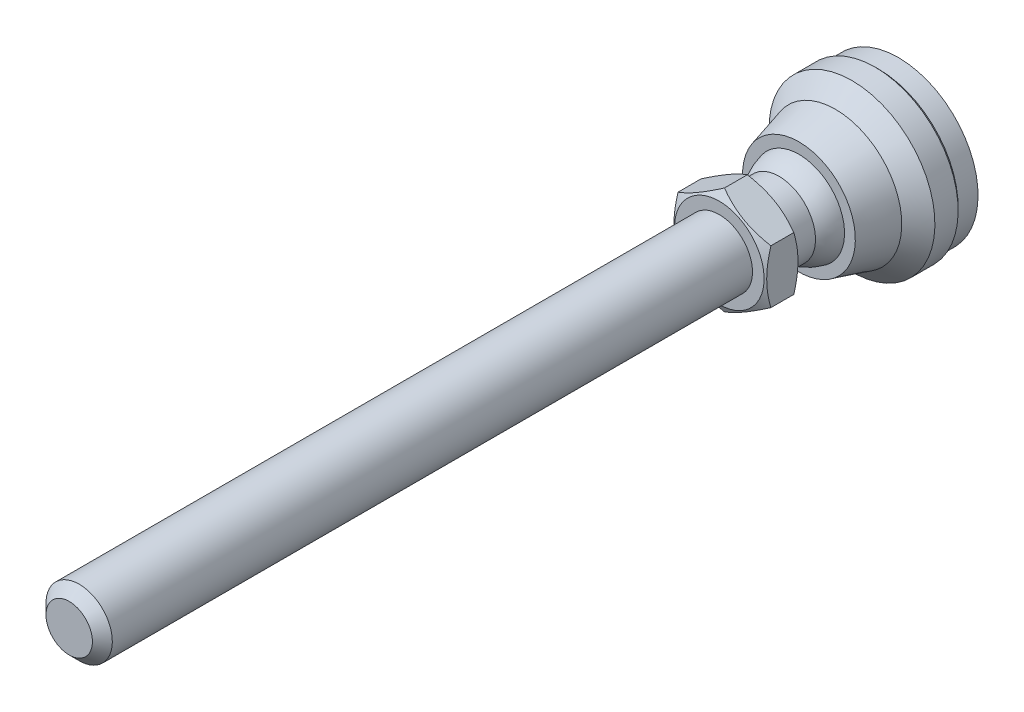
ISO-10303-21;
HEADER;
FILE_DESCRIPTION(('STEP AP214'),'2;1');
FILE_NAME('part.step','',(''),(''),'','','');
FILE_SCHEMA(('AUTOMOTIVE_DESIGN { 1 0 10303 214 1 1 1 1 }'));
ENDSEC;
DATA;
#1=APPLICATION_CONTEXT('core data for automotive mechanical design processes');
#2=APPLICATION_PROTOCOL_DEFINITION('international standard','automotive_design',2000,#1);
#3=PRODUCT_CONTEXT('',#1,'mechanical');
#4=PRODUCT('Part','Part','',(#3));
#5=PRODUCT_RELATED_PRODUCT_CATEGORY('part','',(#4));
#6=PRODUCT_DEFINITION_FORMATION('','',#4);
#7=PRODUCT_DEFINITION_CONTEXT('part definition',#1,'design');
#8=PRODUCT_DEFINITION('design','',#6,#7);
#9=PRODUCT_DEFINITION_SHAPE('','',#8);
#10=(LENGTH_UNIT() NAMED_UNIT(*) SI_UNIT(.MILLI.,.METRE.));
#11=(NAMED_UNIT(*) PLANE_ANGLE_UNIT() SI_UNIT($,.RADIAN.));
#12=(NAMED_UNIT(*) SI_UNIT($,.STERADIAN.) SOLID_ANGLE_UNIT());
#13=UNCERTAINTY_MEASURE_WITH_UNIT(LENGTH_MEASURE(1.E-05),#10,'distance_accuracy_value','');
#14=(GEOMETRIC_REPRESENTATION_CONTEXT(3) GLOBAL_UNCERTAINTY_ASSIGNED_CONTEXT((#13)) GLOBAL_UNIT_ASSIGNED_CONTEXT((#10,
#11,#12)) REPRESENTATION_CONTEXT('',''));
#15=CARTESIAN_POINT('',(0.,0.,0.));
#16=DIRECTION('',(0.,0.,1.));
#17=DIRECTION('',(1.,0.,0.));
#18=AXIS2_PLACEMENT_3D('',#15,#16,#17);
#19=CARTESIAN_POINT('',(-5.49999999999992,0.,22.));
#20=DIRECTION('',(0.,0.,1.));
#21=DIRECTION('',(0.,-1.,0.));
#22=AXIS2_PLACEMENT_3D('',#19,#20,#21);
#23=PLANE('',#22);
#24=CARTESIAN_POINT('',(0.,0.,22.));
#25=DIRECTION('',(0.,0.,1.));
#26=DIRECTION('',(0.,-1.,0.));
#27=AXIS2_PLACEMENT_3D('',#24,#25,#26);
#28=CIRCLE('',#27,6.75);
#29=CARTESIAN_POINT('',(0.,-6.75,22.));
#30=VERTEX_POINT('',#29);
#31=EDGE_CURVE('E440',#30,#30,#28,.T.);
#32=ORIENTED_EDGE('',*,*,#31,.F.);
#33=EDGE_LOOP('',(#32));
#34=FACE_BOUND('',#33,.T.);
#35=CARTESIAN_POINT('',(0.,0.,22.));
#36=DIRECTION('',(0.,0.,-1.));
#37=DIRECTION('',(0.,1.,0.));
#38=AXIS2_PLACEMENT_3D('',#35,#36,#37);
#39=CIRCLE('',#38,5.49999999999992);
#40=CARTESIAN_POINT('',(0.,5.49999999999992,22.));
#41=VERTEX_POINT('',#40);
#42=EDGE_CURVE('E120',#41,#41,#39,.T.);
#43=ORIENTED_EDGE('',*,*,#42,.F.);
#44=EDGE_LOOP('',(#43));
#45=FACE_BOUND('',#44,.T.);
#46=ADVANCED_FACE('F14',(#34,#45),#23,.F.);
#47=CARTESIAN_POINT('',(0.,0.,0.));
#48=DIRECTION('',(0.,0.,-1.));
#49=DIRECTION('',(0.,1.,0.));
#50=AXIS2_PLACEMENT_3D('',#47,#48,#49);
#51=CYLINDRICAL_SURFACE('',#50,5.49999999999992);
#52=CARTESIAN_POINT('',(0.,0.,18.));
#53=DIRECTION('',(0.,0.,-1.));
#54=DIRECTION('',(0.,1.,0.));
#55=AXIS2_PLACEMENT_3D('',#52,#53,#54);
#56=CIRCLE('',#55,5.49999999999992);
#57=CARTESIAN_POINT('',(-5.49999999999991,0.,18.));
#58=VERTEX_POINT('',#57);
#59=EDGE_CURVE('E117',#58,#58,#56,.T.);
#60=ORIENTED_EDGE('',*,*,#59,.F.);
#61=EDGE_LOOP('',(#60));
#62=FACE_BOUND('',#61,.T.);
#63=ORIENTED_EDGE('',*,*,#42,.T.);
#64=EDGE_LOOP('',(#63));
#65=FACE_BOUND('',#64,.T.);
#66=ADVANCED_FACE('F144',(#62,#65),#51,.T.);
#67=CARTESIAN_POINT('',(0.,0.,13.6698729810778));
#68=DIRECTION('',(0.,0.,-1.));
#69=DIRECTION('',(-1.,0.,0.));
#70=AXIS2_PLACEMENT_3D('',#67,#68,#69);
#71=SPHERICAL_SURFACE('',#70,7.);
#72=CARTESIAN_POINT('',(0.,0.,15.));
#73=DIRECTION('',(0.,0.,-1.));
#74=DIRECTION('',(0.,1.,0.));
#75=AXIS2_PLACEMENT_3D('',#72,#73,#74);
#76=CIRCLE('',#75,6.87246404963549);
#77=CARTESIAN_POINT('',(-6.87246404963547,0.,15.));
#78=VERTEX_POINT('',#77);
#79=EDGE_CURVE('E114',#78,#78,#76,.T.);
#80=CARTESIAN_POINT('',(-6.87246404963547,0.,15.));
#81=CARTESIAN_POINT('',(-6.8658721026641,0.,15.0340591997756));
#82=CARTESIAN_POINT('',(-6.85902692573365,0.,15.0680693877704));
#83=CARTESIAN_POINT('',(-6.84483171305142,0.,15.1359842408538));
#84=CARTESIAN_POINT('',(-6.83748167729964,0.,15.1698889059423));
#85=CARTESIAN_POINT('',(-6.82227834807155,0.,15.2375852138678));
#86=CARTESIAN_POINT('',(-6.81442505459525,0.,15.2713768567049));
#87=CARTESIAN_POINT('',(-6.79821695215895,0.,15.3388396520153));
#88=CARTESIAN_POINT('',(-6.78986214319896,0.,15.3725108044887));
#89=CARTESIAN_POINT('',(-6.7726528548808,0.,15.4397251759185));
#90=CARTESIAN_POINT('',(-6.76379837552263,0.,15.473268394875));
#91=CARTESIAN_POINT('',(-6.74559170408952,0.,15.5402194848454));
#92=CARTESIAN_POINT('',(-6.73623951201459,0.,15.5736273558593));
#93=CARTESIAN_POINT('',(-6.71703948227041,0.,15.6403003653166));
#94=CARTESIAN_POINT('',(-6.70719164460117,0.,15.67356550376));
#95=CARTESIAN_POINT('',(-6.68700250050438,0.,15.7399456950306));
#96=CARTESIAN_POINT('',(-6.67666119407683,0.,15.7730607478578));
#97=CARTESIAN_POINT('',(-6.65548739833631,0.,15.8391334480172));
#98=CARTESIAN_POINT('',(-6.64465490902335,0.,15.8720910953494));
#99=CARTESIAN_POINT('',(-6.6225011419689,0.,15.9378416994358));
#100=CARTESIAN_POINT('',(-6.61117986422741,0.,15.9706346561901));
#101=CARTESIAN_POINT('',(-6.5880510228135,0.,16.0360486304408));
#102=CARTESIAN_POINT('',(-6.57624345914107,0.,16.0686696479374));
#103=CARTESIAN_POINT('',(-6.55214465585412,0.,16.1337325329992));
#104=CARTESIAN_POINT('',(-6.5398534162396,0.,16.1661744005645));
#105=CARTESIAN_POINT('',(-6.51478997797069,0.,16.2308718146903));
#106=CARTESIAN_POINT('',(-6.5020177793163,0.,16.2631273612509));
#107=CARTESIAN_POINT('',(-6.47599524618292,0.,16.3274450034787));
#108=CARTESIAN_POINT('',(-6.46274491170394,0.,16.3595070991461));
#109=CARTESIAN_POINT('',(-6.4357690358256,0.,16.4234307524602));
#110=CARTESIAN_POINT('',(-6.42204349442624,0.,16.455292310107));
#111=CARTESIAN_POINT('',(-6.39412023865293,0.,16.5188078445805));
#112=CARTESIAN_POINT('',(-6.37992252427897,0.,16.5504618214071));
#113=CARTESIAN_POINT('',(-6.35105806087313,0.,16.6135551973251));
#114=CARTESIAN_POINT('',(-6.33639131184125,0.,16.6449945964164));
#115=CARTESIAN_POINT('',(-6.30659202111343,0.,16.7076518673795));
#116=CARTESIAN_POINT('',(-6.29145947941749,0.,16.7388697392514));
#117=CARTESIAN_POINT('',(-6.26073194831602,0.,16.8010770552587));
#118=CARTESIAN_POINT('',(-6.24513695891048,0.,16.8320664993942));
#119=CARTESIAN_POINT('',(-6.21348797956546,0.,16.8938101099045));
#120=CARTESIAN_POINT('',(-6.19743398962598,0.,16.9245642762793));
#121=CARTESIAN_POINT('',(-6.16487055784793,0.,16.9858305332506));
#122=CARTESIAN_POINT('',(-6.14836111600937,0.,17.016342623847));
#123=CARTESIAN_POINT('',(-6.11489042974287,0.,17.0771179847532));
#124=CARTESIAN_POINT('',(-6.09792918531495,0.,17.107381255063));
#125=CARTESIAN_POINT('',(-6.06355864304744,0.,17.1676522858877));
#126=CARTESIAN_POINT('',(-6.04614934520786,0.,17.1976600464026));
#127=CARTESIAN_POINT('',(-6.01088654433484,0.,17.2574134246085));
#128=CARTESIAN_POINT('',(-5.99303304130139,0.,17.2871590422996));
#129=CARTESIAN_POINT('',(-5.9568857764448,0.,17.3463815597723));
#130=CARTESIAN_POINT('',(-5.93859201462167,0.,17.3758584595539));
#131=CARTESIAN_POINT('',(-5.90156827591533,0.,17.4345370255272));
#132=CARTESIAN_POINT('',(-5.88283829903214,0.,17.4637386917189));
#133=CARTESIAN_POINT('',(-5.84494627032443,0.,17.5218603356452));
#134=CARTESIAN_POINT('',(-5.82578421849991,0.,17.5507803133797));
#135=CARTESIAN_POINT('',(-5.78703227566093,0.,17.6083321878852));
#136=CARTESIAN_POINT('',(-5.76744238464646,0.,17.6369640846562));
#137=CARTESIAN_POINT('',(-5.72783909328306,0.,17.6939334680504));
#138=CARTESIAN_POINT('',(-5.70782569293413,0.,17.7222709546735));
#139=CARTESIAN_POINT('',(-5.66737980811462,0.,17.778645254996));
#140=CARTESIAN_POINT('',(-5.64694732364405,0.,17.8066820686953));
#141=CARTESIAN_POINT('',(-5.60566778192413,0.,17.862448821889));
#142=CARTESIAN_POINT('',(-5.58482072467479,0.,17.8901787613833));
#143=CARTESIAN_POINT('',(-5.54271666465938,0.,17.9453256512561));
#144=CARTESIAN_POINT('',(-5.52145966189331,0.,17.9727426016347));
#145=CARTESIAN_POINT('',(-5.49999999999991,0.,18.));
#146=B_SPLINE_CURVE_WITH_KNOTS('',3,(#80,#81,#82,#83,#84,#85,#86,#87,#88,#89,#90,#91,#92,#93,
#94,#95,#96,#97,#98,#99,#100,#101,#102,#103,#104,#105,#106,#107,#108,#109,#110,#111,#112,#113,
#114,#115,#116,#117,#118,#119,#120,#121,#122,#123,#124,#125,#126,#127,#128,#129,#130,#131,#132,
#133,#134,#135,#136,#137,#138,#139,#140,#141,#142,#143,#144,#145),.UNSPECIFIED.,.F.,.F.,(4,2,2,
2,2,2,2,2,2,2,2,2,2,2,2,2,2,2,2,2,2,2,2,2,2,2,2,2,2,2,2,2,4),(0.,0.104072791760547,
0.20814558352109,0.312218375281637,0.416291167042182,0.520363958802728,0.624436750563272,
0.728509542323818,0.832582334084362,0.936655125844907,1.04072791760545,1.144800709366,
1.24887350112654,1.35294629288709,1.45701908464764,1.56109187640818,1.66516466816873,
1.76923745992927,1.87331025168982,1.97738304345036,2.0814558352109,2.18552862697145,
2.289601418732,2.39367421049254,2.49774700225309,2.60181979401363,2.70589258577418,
2.80996537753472,2.91403816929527,3.01811096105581,3.12218375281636,3.2262565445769,
3.33032933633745),.UNSPECIFIED.);
#147=EDGE_CURVE('BSEAM151',#78,#58,#146,.T.);
#148=ORIENTED_EDGE('',*,*,#79,.F.);
#149=ORIENTED_EDGE('',*,*,#59,.T.);
#150=ORIENTED_EDGE('',*,*,#147,.T.);
#151=ORIENTED_EDGE('',*,*,#147,.F.);
#152=EDGE_LOOP('',(#148,#150,#149,#151));
#153=FACE_BOUND('',#152,.T.);
#154=ADVANCED_FACE('F151',(#153),#71,.T.);
#155=CARTESIAN_POINT('',(-8.5,0.,15.));
#156=DIRECTION('',(0.,0.,-1.));
#157=DIRECTION('',(0.,1.,0.));
#158=AXIS2_PLACEMENT_3D('',#155,#156,#157);
#159=PLANE('',#158);
#160=CARTESIAN_POINT('',(0.,0.,15.));
#161=DIRECTION('',(0.,0.,-1.));
#162=DIRECTION('',(0.,1.,0.));
#163=AXIS2_PLACEMENT_3D('',#160,#161,#162);
#164=CIRCLE('',#163,8.5);
#165=CARTESIAN_POINT('',(0.,8.5,15.));
#166=VERTEX_POINT('',#165);
#167=EDGE_CURVE('E111',#166,#166,#164,.T.);
#168=ORIENTED_EDGE('',*,*,#167,.F.);
#169=EDGE_LOOP('',(#168));
#170=FACE_BOUND('',#169,.T.);
#171=ORIENTED_EDGE('',*,*,#79,.T.);
#172=EDGE_LOOP('',(#171));
#173=FACE_BOUND('',#172,.T.);
#174=ADVANCED_FACE('F303',(#170,#173),#159,.F.);
#175=CARTESIAN_POINT('',(0.,0.,15.));
#176=DIRECTION('',(0.,0.,-1.));
#177=DIRECTION('',(0.,1.,0.));
#178=AXIS2_PLACEMENT_3D('',#175,#176,#177);
#179=CONICAL_SURFACE('',#178,8.5,0.266252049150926);
#180=CARTESIAN_POINT('',(0.,0.,9.5));
#181=DIRECTION('',(0.,0.,-1.));
#182=DIRECTION('',(0.,1.,0.));
#183=AXIS2_PLACEMENT_3D('',#180,#181,#182);
#184=CIRCLE('',#183,10.);
#185=CARTESIAN_POINT('',(0.,10.,9.5));
#186=VERTEX_POINT('',#185);
#187=EDGE_CURVE('E108',#186,#186,#184,.T.);
#188=ORIENTED_EDGE('',*,*,#187,.F.);
#189=EDGE_LOOP('',(#188));
#190=FACE_BOUND('',#189,.T.);
#191=ORIENTED_EDGE('',*,*,#167,.T.);
#192=EDGE_LOOP('',(#191));
#193=FACE_BOUND('',#192,.T.);
#194=ADVANCED_FACE('F293',(#190,#193),#179,.T.);
#195=CARTESIAN_POINT('',(0.,0.,9.5));
#196=DIRECTION('',(0.,0.,-1.));
#197=DIRECTION('',(0.,1.,0.));
#198=AXIS2_PLACEMENT_3D('',#195,#196,#197);
#199=CONICAL_SURFACE('',#198,10.,0.785398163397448);
#200=CARTESIAN_POINT('',(0.,0.,7.));
#201=DIRECTION('',(0.,0.,-1.));
#202=DIRECTION('',(0.,1.,0.));
#203=AXIS2_PLACEMENT_3D('',#200,#201,#202);
#204=CIRCLE('',#203,12.5);
#205=CARTESIAN_POINT('',(0.,12.5,7.));
#206=VERTEX_POINT('',#205);
#207=EDGE_CURVE('E105',#206,#206,#204,.T.);
#208=ORIENTED_EDGE('',*,*,#207,.F.);
#209=EDGE_LOOP('',(#208));
#210=FACE_BOUND('',#209,.T.);
#211=ORIENTED_EDGE('',*,*,#187,.T.);
#212=EDGE_LOOP('',(#211));
#213=FACE_BOUND('',#212,.T.);
#214=ADVANCED_FACE('F283',(#210,#213),#199,.T.);
#215=CARTESIAN_POINT('',(0.,0.,0.));
#216=DIRECTION('',(0.,0.,-1.));
#217=DIRECTION('',(0.,1.,0.));
#218=AXIS2_PLACEMENT_3D('',#215,#216,#217);
#219=CYLINDRICAL_SURFACE('',#218,12.5);
#220=CARTESIAN_POINT('',(0.,0.,3.5));
#221=DIRECTION('',(0.,0.,-1.));
#222=DIRECTION('',(0.,1.,0.));
#223=AXIS2_PLACEMENT_3D('',#220,#221,#222);
#224=CIRCLE('',#223,12.5);
#225=CARTESIAN_POINT('',(0.,12.5,3.5));
#226=VERTEX_POINT('',#225);
#227=EDGE_CURVE('E102',#226,#226,#224,.T.);
#228=ORIENTED_EDGE('',*,*,#227,.F.);
#229=EDGE_LOOP('',(#228));
#230=FACE_BOUND('',#229,.T.);
#231=ORIENTED_EDGE('',*,*,#207,.T.);
#232=EDGE_LOOP('',(#231));
#233=FACE_BOUND('',#232,.T.);
#234=ADVANCED_FACE('F273',(#230,#233),#219,.T.);
#235=CARTESIAN_POINT('',(0.,0.,3.5));
#236=DIRECTION('',(0.,0.,1.));
#237=DIRECTION('',(0.,-1.,0.));
#238=AXIS2_PLACEMENT_3D('',#235,#236,#237);
#239=CONICAL_SURFACE('',#238,12.5,0.785398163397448);
#240=CARTESIAN_POINT('',(0.,0.,3.));
#241=DIRECTION('',(0.,0.,-1.));
#242=DIRECTION('',(0.,1.,0.));
#243=AXIS2_PLACEMENT_3D('',#240,#241,#242);
#244=CIRCLE('',#243,12.);
#245=CARTESIAN_POINT('',(0.,12.,3.));
#246=VERTEX_POINT('',#245);
#247=EDGE_CURVE('E99',#246,#246,#244,.T.);
#248=ORIENTED_EDGE('',*,*,#247,.F.);
#249=EDGE_LOOP('',(#248));
#250=FACE_BOUND('',#249,.T.);
#251=ORIENTED_EDGE('',*,*,#227,.T.);
#252=EDGE_LOOP('',(#251));
#253=FACE_BOUND('',#252,.T.);
#254=ADVANCED_FACE('F263',(#250,#253),#239,.T.);
#255=CARTESIAN_POINT('',(0.,0.,0.));
#256=DIRECTION('',(0.,0.,-1.));
#257=DIRECTION('',(0.,1.,0.));
#258=AXIS2_PLACEMENT_3D('',#255,#256,#257);
#259=CYLINDRICAL_SURFACE('',#258,12.);
#260=CARTESIAN_POINT('',(0.,0.,0.));
#261=DIRECTION('',(0.,0.,-1.));
#262=DIRECTION('',(0.,1.,0.));
#263=AXIS2_PLACEMENT_3D('',#260,#261,#262);
#264=CIRCLE('',#263,12.);
#265=CARTESIAN_POINT('',(0.,12.,0.));
#266=VERTEX_POINT('',#265);
#267=EDGE_CURVE('E96',#266,#266,#264,.T.);
#268=ORIENTED_EDGE('',*,*,#267,.F.);
#269=EDGE_LOOP('',(#268));
#270=FACE_BOUND('',#269,.T.);
#271=ORIENTED_EDGE('',*,*,#247,.T.);
#272=EDGE_LOOP('',(#271));
#273=FACE_BOUND('',#272,.T.);
#274=ADVANCED_FACE('F252',(#270,#273),#259,.T.);
#275=CARTESIAN_POINT('',(-12.,0.,0.));
#276=DIRECTION('',(0.,0.,1.));
#277=DIRECTION('',(0.,-1.,0.));
#278=AXIS2_PLACEMENT_3D('',#275,#276,#277);
#279=PLANE('',#278);
#280=ORIENTED_EDGE('',*,*,#267,.T.);
#281=EDGE_LOOP('',(#280));
#282=FACE_BOUND('',#281,.T.);
#283=ADVANCED_FACE('F142',(#282),#279,.F.);
#284=CARTESIAN_POINT('',(0.,0.,22.));
#285=DIRECTION('',(0.,0.,1.));
#286=DIRECTION('',(0.,-1.,0.));
#287=AXIS2_PLACEMENT_3D('',#284,#285,#286);
#288=CONICAL_SURFACE('',#287,6.75,1.0471975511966);
#289=CARTESIAN_POINT('',(0.000200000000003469,-8.0830192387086,22.7696190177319));
#290=CARTESIAN_POINT('',(-0.15366790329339,-7.99418356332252,22.7183374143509));
#291=CARTESIAN_POINT('',(-0.308109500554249,-7.90501666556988,22.669383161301));
#292=CARTESIAN_POINT('',(-0.618246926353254,-7.72595873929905,22.5767703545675));
#293=CARTESIAN_POINT('',(-0.773943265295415,-7.63606741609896,22.5331140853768));
#294=CARTESIAN_POINT('',(-1.24352516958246,-7.36495417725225,22.4109491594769));
#295=CARTESIAN_POINT('',(-1.5592643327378,-7.18266208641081,22.3414631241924));
#296=CARTESIAN_POINT('',(-2.03176224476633,-6.90986528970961,22.2599825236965));
#297=CARTESIAN_POINT('',(-2.18710922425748,-6.82017566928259,22.2367710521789));
#298=CARTESIAN_POINT('',(-2.49850511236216,-6.64039116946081,22.1978487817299));
#299=CARTESIAN_POINT('',(-2.65455395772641,-6.55029632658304,22.1821373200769));
#300=CARTESIAN_POINT('',(-2.96692267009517,-6.36995016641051,22.1586154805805));
#301=CARTESIAN_POINT('',(-3.12324202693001,-6.27969914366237,22.1507961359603));
#302=CARTESIAN_POINT('',(-3.43601650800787,-6.09911871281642,22.1432178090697));
#303=CARTESIAN_POINT('',(-3.59247162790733,-6.00878930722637,22.1434585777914));
#304=CARTESIAN_POINT('',(-4.02110687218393,-5.76131663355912,22.155197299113));
#305=CARTESIAN_POINT('',(-4.2931466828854,-5.60425437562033,22.1749033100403));
#306=CARTESIAN_POINT('',(-4.83541944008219,-5.29117305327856,22.2373910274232));
#307=CARTESIAN_POINT('',(-5.10565047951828,-5.13515508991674,22.2801940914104));
#308=CARTESIAN_POINT('',(-5.64901454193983,-4.82144370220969,22.3871892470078));
#309=CARTESIAN_POINT('',(-5.92207900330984,-4.6637898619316,22.4518346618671));
#310=CARTESIAN_POINT('',(-6.46413578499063,-4.35083323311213,22.5985536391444));
#311=CARTESIAN_POINT('',(-6.73313504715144,-4.19552643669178,22.680592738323));
#312=CARTESIAN_POINT('',(-7.0002,-4.04133641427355,22.7696190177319));
#313=B_SPLINE_CURVE_WITH_KNOTS('',3,(#289,#290,#291,#292,#293,#294,#295,#296,#297,#298,#299,
#300,#301,#302,#303,#304,#305,#306,#307,#308,#309,#310,#311,#312),.UNSPECIFIED.,.F.,.F.,(4,2,2,
2,2,2,2,2,2,2,2,4),(0.,0.554727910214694,1.10969417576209,2.2219327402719,2.76443041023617,
3.30688013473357,3.8487128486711,4.39052882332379,5.33376515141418,6.27787517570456,
7.24292418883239,8.20607866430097),.UNSPECIFIED.);
#314=CARTESIAN_POINT('',(0.,-8.08290376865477,22.7695523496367));
#315=VERTEX_POINT('',#314);
#316=CARTESIAN_POINT('',(-7.,-4.04145188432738,22.7695523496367));
#317=VERTEX_POINT('',#316);
#318=EDGE_CURVE('E73',#315,#317,#313,.T.);
#319=ORIENTED_EDGE('',*,*,#318,.T.);
#320=CARTESIAN_POINT('',(-7.,10.812673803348,25.5395945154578));
#321=CARTESIAN_POINT('',(-7.,10.5072958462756,25.3916329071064));
#322=CARTESIAN_POINT('',(-7.,10.2012122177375,25.24510256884));
#323=CARTESIAN_POINT('',(-7.,9.58725816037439,24.9557102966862));
#324=CARTESIAN_POINT('',(-7.,9.27938745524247,24.8128489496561));
#325=CARTESIAN_POINT('',(-7.,8.65987674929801,24.5308725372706));
#326=CARTESIAN_POINT('',(-7.,8.34822532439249,24.3917824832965));
#327=CARTESIAN_POINT('',(-7.,7.7224285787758,24.1193524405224));
#328=CARTESIAN_POINT('',(-7.,7.40828337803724,23.9860121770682));
#329=CARTESIAN_POINT('',(-7.,6.76702963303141,23.7225044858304));
#330=CARTESIAN_POINT('',(-7.,6.43982484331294,23.5925699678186));
#331=CARTESIAN_POINT('',(-7.,5.78157207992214,23.3426397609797));
#332=CARTESIAN_POINT('',(-7.,5.4505236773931,23.2226451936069));
#333=CARTESIAN_POINT('',(-7.,4.78468670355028,22.9957770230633));
#334=CARTESIAN_POINT('',(-7.,4.44990741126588,22.8888764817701));
#335=CARTESIAN_POINT('',(-7.,3.77555914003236,22.6916535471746));
#336=CARTESIAN_POINT('',(-7.,3.43599172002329,22.6013258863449));
#337=CARTESIAN_POINT('',(-7.,2.75369265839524,22.4420957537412));
#338=CARTESIAN_POINT('',(-7.,2.41098847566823,22.3730788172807));
#339=CARTESIAN_POINT('',(-7.,1.89384626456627,22.2885462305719));
#340=CARTESIAN_POINT('',(-7.,1.72093817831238,22.2635330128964));
#341=CARTESIAN_POINT('',(-7.,1.37427732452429,22.2203290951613));
#342=CARTESIAN_POINT('',(-7.,1.20052464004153,22.2021377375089));
#343=CARTESIAN_POINT('',(-7.,0.854658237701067,22.1731658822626));
#344=CARTESIAN_POINT('',(-7.,0.682552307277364,22.1622927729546));
#345=CARTESIAN_POINT('',(-7.,0.338035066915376,22.1478313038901));
#346=CARTESIAN_POINT('',(-7.,0.165623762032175,22.1442428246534));
#347=CARTESIAN_POINT('',(-7.,-0.179196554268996,22.1444361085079));
#348=CARTESIAN_POINT('',(-7.,-0.351605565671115,22.1482179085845));
#349=CARTESIAN_POINT('',(-7.,-0.696112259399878,22.1630600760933));
#350=CARTESIAN_POINT('',(-7.,-0.868209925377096,22.1741208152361));
#351=CARTESIAN_POINT('',(-7.,-1.2831299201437,22.2093299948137));
#352=CARTESIAN_POINT('',(-7.,-1.5256591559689,22.2370051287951));
#353=CARTESIAN_POINT('',(-7.,-2.00887768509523,22.3052913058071));
#354=CARTESIAN_POINT('',(-7.,-2.24956671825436,22.3459041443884));
#355=CARTESIAN_POINT('',(-7.,-2.96862070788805,22.4849922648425));
#356=CARTESIAN_POINT('',(-7.,-3.44369601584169,22.6006906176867));
#357=CARTESIAN_POINT('',(-7.,-4.15400509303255,22.8008201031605));
#358=CARTESIAN_POINT('',(-7.,-4.39293574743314,22.8728804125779));
#359=CARTESIAN_POINT('',(-7.,-4.86847553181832,23.0243603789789));
#360=CARTESIAN_POINT('',(-7.,-5.10508464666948,23.1037800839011));
#361=CARTESIAN_POINT('',(-7.,-5.57605822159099,23.2687149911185));
#362=CARTESIAN_POINT('',(-7.,-5.81042342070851,23.3542281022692));
#363=CARTESIAN_POINT('',(-7.,-6.27722046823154,23.5303561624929));
#364=CARTESIAN_POINT('',(-7.,-6.50965233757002,23.620971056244));
#365=CARTESIAN_POINT('',(-7.,-7.05113691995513,23.8378263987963));
#366=CARTESIAN_POINT('',(-7.,-7.35951426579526,23.9657499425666));
#367=CARTESIAN_POINT('',(-7.,-7.97370763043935,24.2276218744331));
#368=CARTESIAN_POINT('',(-7.,-8.27952350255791,24.3615706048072));
#369=CARTESIAN_POINT('',(-7.,-8.88905585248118,24.6343026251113));
#370=CARTESIAN_POINT('',(-7.,-9.19277192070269,24.7730868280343));
#371=CARTESIAN_POINT('',(-7.,-9.79840263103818,25.0545384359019));
#372=CARTESIAN_POINT('',(-7.,-10.1003172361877,25.1972059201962));
#373=CARTESIAN_POINT('',(-7.,-10.7029368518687,25.4858508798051));
#374=CARTESIAN_POINT('',(-7.,-11.0036403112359,25.6318315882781));
#375=CARTESIAN_POINT('',(-7.,-11.6037651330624,25.9264073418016));
#376=CARTESIAN_POINT('',(-7.,-11.9031864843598,26.0750024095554));
#377=CARTESIAN_POINT('',(-7.,-12.7997540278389,26.5239864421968));
#378=CARTESIAN_POINT('',(-7.,-13.3952797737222,26.8276109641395));
#379=CARTESIAN_POINT('',(-7.,-14.5345308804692,27.4158411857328));
#380=CARTESIAN_POINT('',(-7.,-15.0785045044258,27.6999681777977));
#381=CARTESIAN_POINT('',(-7.,-16.1644249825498,28.2721098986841));
#382=CARTESIAN_POINT('',(-7.,-16.7063717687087,28.5601247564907));
#383=CARTESIAN_POINT('',(-7.,-17.7873838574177,29.138429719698));
#384=CARTESIAN_POINT('',(-7.,-18.3264529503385,29.4287127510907));
#385=CARTESIAN_POINT('',(-7.,-19.4032911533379,30.011613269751));
#386=CARTESIAN_POINT('',(-7.,-19.9410603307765,30.3042306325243));
#387=CARTESIAN_POINT('',(-7.,-20.4783490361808,30.5977216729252));
#388=B_SPLINE_CURVE_WITH_KNOTS('',3,(#320,#321,#322,#323,#324,#325,#326,#327,#328,#329,#330,
#331,#332,#333,#334,#335,#336,#337,#338,#339,#340,#341,#342,#343,#344,#345,#346,#347,#348,#349,
#350,#351,#352,#353,#354,#355,#356,#357,#358,#359,#360,#361,#362,#363,#364,#365,#366,#367,#368,
#369,#370,#371,#372,#373,#374,#375,#376,#377,#378,#379,#380,#381,#382,#383,#384,#385,#386,#387),
.UNSPECIFIED.,.F.,.F.,(4,2,2,2,2,2,2,2,2,2,2,2,2,2,2,2,2,2,2,2,2,2,2,2,2,2,2,2,2,2,2,2,2,4),(0.,
1.01801804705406,2.03619792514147,3.05999411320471,4.08374134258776,5.139794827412,
6.19596729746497,7.24992906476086,8.30355525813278,9.35141958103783,9.87543000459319,
10.3993899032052,10.9165877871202,11.4337771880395,11.9509691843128,12.4681875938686,
13.2000825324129,13.9320790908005,15.3969019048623,16.1455231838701,16.8941493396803,
17.6425198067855,18.3908821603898,19.3923699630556,20.3939147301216,21.3956496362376,
22.3974050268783,23.4001839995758,24.4029716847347,26.4082936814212,28.2493958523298,
30.0905592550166,31.9273268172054,33.7639970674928),.UNSPECIFIED.);
#389=CARTESIAN_POINT('',(-7.,4.04145188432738,22.7695523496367));
#390=VERTEX_POINT('',#389);
#391=EDGE_CURVE('E81',#317,#390,#388,.F.);
#392=ORIENTED_EDGE('',*,*,#391,.T.);
#393=CARTESIAN_POINT('',(-7.0002,4.04133641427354,22.7696190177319));
#394=CARTESIAN_POINT('',(-6.84633209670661,4.13017208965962,22.7183374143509));
#395=CARTESIAN_POINT('',(-6.69189049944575,4.21933898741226,22.669383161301));
#396=CARTESIAN_POINT('',(-6.38175307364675,4.39839691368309,22.5767703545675));
#397=CARTESIAN_POINT('',(-6.22605673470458,4.48828823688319,22.5331140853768));
#398=CARTESIAN_POINT('',(-5.75647483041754,4.75940147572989,22.4109491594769));
#399=CARTESIAN_POINT('',(-5.4407356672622,4.94169356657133,22.3414631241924));
#400=CARTESIAN_POINT('',(-4.96823775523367,5.21449036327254,22.2599825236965));
#401=CARTESIAN_POINT('',(-4.81289077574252,5.30417998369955,22.2367710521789));
#402=CARTESIAN_POINT('',(-4.50149488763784,5.48396448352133,22.1978487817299));
#403=CARTESIAN_POINT('',(-4.34544604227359,5.57405932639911,22.1821373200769));
#404=CARTESIAN_POINT('',(-4.03307732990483,5.75440548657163,22.1586154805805));
#405=CARTESIAN_POINT('',(-3.87675797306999,5.84465650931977,22.1507961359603));
#406=CARTESIAN_POINT('',(-3.56398349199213,6.02523694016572,22.1432178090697));
#407=CARTESIAN_POINT('',(-3.40752837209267,6.11556634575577,22.1434585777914));
#408=CARTESIAN_POINT('',(-2.97889312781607,6.36303901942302,22.155197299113));
#409=CARTESIAN_POINT('',(-2.7068533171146,6.52010127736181,22.1749033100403));
#410=CARTESIAN_POINT('',(-2.16458055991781,6.83318259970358,22.2373910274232));
#411=CARTESIAN_POINT('',(-1.89434952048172,6.9892005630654,22.2801940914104));
#412=CARTESIAN_POINT('',(-1.35098545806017,7.30291195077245,22.3871892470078));
#413=CARTESIAN_POINT('',(-1.07792099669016,7.46056579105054,22.4518346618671));
#414=CARTESIAN_POINT('',(-0.535864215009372,7.77352241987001,22.5985536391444));
#415=CARTESIAN_POINT('',(-0.266864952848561,7.92882921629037,22.680592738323));
#416=CARTESIAN_POINT('',(0.00019999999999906,8.0830192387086,22.7696190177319));
#417=B_SPLINE_CURVE_WITH_KNOTS('',3,(#393,#394,#395,#396,#397,#398,#399,#400,#401,#402,#403,
#404,#405,#406,#407,#408,#409,#410,#411,#412,#413,#414,#415,#416),.UNSPECIFIED.,.F.,.F.,(4,2,2,
2,2,2,2,2,2,2,2,4),(0.,0.554727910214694,1.10969417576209,2.2219327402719,2.76443041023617,
3.30688013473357,3.84871284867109,4.39052882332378,5.33376515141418,6.27787517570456,
7.2429241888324,8.20607866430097),.UNSPECIFIED.);
#418=CARTESIAN_POINT('',(0.,8.08290376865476,22.7695523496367));
#419=VERTEX_POINT('',#418);
#420=EDGE_CURVE('E395',#390,#419,#417,.T.);
#421=ORIENTED_EDGE('',*,*,#420,.T.);
#422=CARTESIAN_POINT('',(-0.000200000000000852,8.0830192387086,22.7696190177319));
#423=CARTESIAN_POINT('',(0.153667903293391,7.99418356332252,22.7183374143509));
#424=CARTESIAN_POINT('',(0.308109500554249,7.90501666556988,22.669383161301));
#425=CARTESIAN_POINT('',(0.618246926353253,7.72595873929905,22.5767703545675));
#426=CARTESIAN_POINT('',(0.773943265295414,7.63606741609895,22.5331140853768));
#427=CARTESIAN_POINT('',(1.24352516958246,7.36495417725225,22.4109491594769));
#428=CARTESIAN_POINT('',(1.5592643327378,7.18266208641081,22.3414631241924));
#429=CARTESIAN_POINT('',(2.03176224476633,6.9098652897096,22.2599825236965));
#430=CARTESIAN_POINT('',(2.18710922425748,6.82017566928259,22.2367710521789));
#431=CARTESIAN_POINT('',(2.49850511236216,6.64039116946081,22.1978487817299));
#432=CARTESIAN_POINT('',(2.65455395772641,6.55029632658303,22.1821373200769));
#433=CARTESIAN_POINT('',(2.96692267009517,6.36995016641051,22.1586154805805));
#434=CARTESIAN_POINT('',(3.12324202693,6.27969914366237,22.1507961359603));
#435=CARTESIAN_POINT('',(3.43601650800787,6.09911871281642,22.1432178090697));
#436=CARTESIAN_POINT('',(3.59247162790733,6.00878930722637,22.1434585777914));
#437=CARTESIAN_POINT('',(4.02110687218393,5.76131663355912,22.155197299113));
#438=CARTESIAN_POINT('',(4.2931466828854,5.60425437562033,22.1749033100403));
#439=CARTESIAN_POINT('',(4.83541944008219,5.29117305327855,22.2373910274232));
#440=CARTESIAN_POINT('',(5.10565047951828,5.13515508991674,22.2801940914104));
#441=CARTESIAN_POINT('',(5.64901454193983,4.82144370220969,22.3871892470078));
#442=CARTESIAN_POINT('',(5.92207900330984,4.66378986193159,22.4518346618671));
#443=CARTESIAN_POINT('',(6.46413578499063,4.35083323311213,22.5985536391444));
#444=CARTESIAN_POINT('',(6.73313504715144,4.19552643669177,22.680592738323));
#445=CARTESIAN_POINT('',(7.0002,4.04133641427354,22.7696190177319));
#446=B_SPLINE_CURVE_WITH_KNOTS('',3,(#422,#423,#424,#425,#426,#427,#428,#429,#430,#431,#432,
#433,#434,#435,#436,#437,#438,#439,#440,#441,#442,#443,#444,#445),.UNSPECIFIED.,.F.,.F.,(4,2,2,
2,2,2,2,2,2,2,2,4),(0.,0.554727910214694,1.10969417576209,2.2219327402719,2.76443041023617,
3.30688013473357,3.8487128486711,4.39052882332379,5.33376515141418,6.27787517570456,
7.2429241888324,8.20607866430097),.UNSPECIFIED.);
#447=CARTESIAN_POINT('',(7.,4.04145188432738,22.7695523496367));
#448=VERTEX_POINT('',#447);
#449=EDGE_CURVE('E390',#419,#448,#446,.T.);
#450=ORIENTED_EDGE('',*,*,#449,.T.);
#451=CARTESIAN_POINT('',(7.,10.8126738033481,25.5395945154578));
#452=CARTESIAN_POINT('',(7.,10.5072958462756,25.3916329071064));
#453=CARTESIAN_POINT('',(7.,10.2012122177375,25.24510256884));
#454=CARTESIAN_POINT('',(7.,9.5872581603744,24.9557102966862));
#455=CARTESIAN_POINT('',(7.,9.27938745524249,24.8128489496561));
#456=CARTESIAN_POINT('',(7.,8.65987674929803,24.5308725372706));
#457=CARTESIAN_POINT('',(7.,8.3482253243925,24.3917824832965));
#458=CARTESIAN_POINT('',(7.,7.72242857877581,24.1193524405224));
#459=CARTESIAN_POINT('',(7.,7.40828337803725,23.9860121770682));
#460=CARTESIAN_POINT('',(7.,6.76702963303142,23.7225044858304));
#461=CARTESIAN_POINT('',(7.,6.43982484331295,23.5925699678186));
#462=CARTESIAN_POINT('',(7.,5.78157207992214,23.3426397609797));
#463=CARTESIAN_POINT('',(7.,5.45052367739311,23.2226451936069));
#464=CARTESIAN_POINT('',(7.,4.78468670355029,22.9957770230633));
#465=CARTESIAN_POINT('',(7.,4.44990741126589,22.8888764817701));
#466=CARTESIAN_POINT('',(7.,3.77555914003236,22.6916535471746));
#467=CARTESIAN_POINT('',(7.,3.4359917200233,22.6013258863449));
#468=CARTESIAN_POINT('',(7.,2.75369265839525,22.4420957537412));
#469=CARTESIAN_POINT('',(7.,2.41098847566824,22.3730788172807));
#470=CARTESIAN_POINT('',(7.,1.89384626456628,22.2885462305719));
#471=CARTESIAN_POINT('',(7.,1.72093817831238,22.2635330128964));
#472=CARTESIAN_POINT('',(7.,1.3742773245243,22.2203290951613));
#473=CARTESIAN_POINT('',(7.,1.20052464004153,22.2021377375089));
#474=CARTESIAN_POINT('',(7.,0.854658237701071,22.1731658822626));
#475=CARTESIAN_POINT('',(7.,0.682552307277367,22.1622927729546));
#476=CARTESIAN_POINT('',(7.,0.338035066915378,22.1478313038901));
#477=CARTESIAN_POINT('',(7.,0.165623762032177,22.1442428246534));
#478=CARTESIAN_POINT('',(7.,-0.179196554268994,22.1444361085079));
#479=CARTESIAN_POINT('',(7.,-0.351605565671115,22.1482179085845));
#480=CARTESIAN_POINT('',(7.,-0.696112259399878,22.1630600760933));
#481=CARTESIAN_POINT('',(7.,-0.868209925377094,22.1741208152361));
#482=CARTESIAN_POINT('',(7.,-1.2831299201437,22.2093299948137));
#483=CARTESIAN_POINT('',(7.,-1.5256591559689,22.2370051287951));
#484=CARTESIAN_POINT('',(7.,-2.00887768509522,22.3052913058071));
#485=CARTESIAN_POINT('',(7.,-2.24956671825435,22.3459041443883));
#486=CARTESIAN_POINT('',(7.,-2.96862070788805,22.4849922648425));
#487=CARTESIAN_POINT('',(7.,-3.44369601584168,22.6006906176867));
#488=CARTESIAN_POINT('',(7.,-4.15400509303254,22.8008201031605));
#489=CARTESIAN_POINT('',(7.,-4.39293574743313,22.8728804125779));
#490=CARTESIAN_POINT('',(7.,-4.86847553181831,23.0243603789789));
#491=CARTESIAN_POINT('',(7.,-5.10508464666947,23.1037800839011));
#492=CARTESIAN_POINT('',(7.,-5.57605822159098,23.2687149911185));
#493=CARTESIAN_POINT('',(7.,-5.8104234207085,23.3542281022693));
#494=CARTESIAN_POINT('',(7.,-6.27722046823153,23.5303561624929));
#495=CARTESIAN_POINT('',(7.,-6.50965233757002,23.620971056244));
#496=CARTESIAN_POINT('',(7.,-7.05113691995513,23.8378263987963));
#497=CARTESIAN_POINT('',(7.,-7.35951426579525,23.9657499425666));
#498=CARTESIAN_POINT('',(7.,-7.97370763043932,24.2276218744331));
#499=CARTESIAN_POINT('',(7.,-8.27952350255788,24.3615706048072));
#500=CARTESIAN_POINT('',(7.,-8.88905585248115,24.6343026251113));
#501=CARTESIAN_POINT('',(7.,-9.19277192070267,24.7730868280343));
#502=CARTESIAN_POINT('',(7.,-9.79840263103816,25.0545384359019));
#503=CARTESIAN_POINT('',(7.,-10.1003172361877,25.1972059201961));
#504=CARTESIAN_POINT('',(7.,-10.7029368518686,25.4858508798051));
#505=CARTESIAN_POINT('',(7.,-11.0036403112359,25.6318315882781));
#506=CARTESIAN_POINT('',(7.,-11.6037651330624,25.9264073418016));
#507=CARTESIAN_POINT('',(7.,-11.9031864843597,26.0750024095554));
#508=CARTESIAN_POINT('',(7.,-12.7997540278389,26.5239864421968));
#509=CARTESIAN_POINT('',(7.,-13.3952797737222,26.8276109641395));
#510=CARTESIAN_POINT('',(7.,-14.5345308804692,27.4158411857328));
#511=CARTESIAN_POINT('',(7.,-15.0785045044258,27.6999681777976));
#512=CARTESIAN_POINT('',(7.,-16.1644249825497,28.2721098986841));
#513=CARTESIAN_POINT('',(7.,-16.7063717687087,28.5601247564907));
#514=CARTESIAN_POINT('',(7.,-17.7873838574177,29.138429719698));
#515=CARTESIAN_POINT('',(7.,-18.3264529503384,29.4287127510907));
#516=CARTESIAN_POINT('',(7.,-19.4032911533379,30.011613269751));
#517=CARTESIAN_POINT('',(7.,-19.9410603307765,30.3042306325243));
#518=CARTESIAN_POINT('',(7.,-20.4783490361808,30.5977216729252));
#519=B_SPLINE_CURVE_WITH_KNOTS('',3,(#451,#452,#453,#454,#455,#456,#457,#458,#459,#460,#461,
#462,#463,#464,#465,#466,#467,#468,#469,#470,#471,#472,#473,#474,#475,#476,#477,#478,#479,#480,
#481,#482,#483,#484,#485,#486,#487,#488,#489,#490,#491,#492,#493,#494,#495,#496,#497,#498,#499,
#500,#501,#502,#503,#504,#505,#506,#507,#508,#509,#510,#511,#512,#513,#514,#515,#516,#517,#518),
.UNSPECIFIED.,.F.,.F.,(4,2,2,2,2,2,2,2,2,2,2,2,2,2,2,2,2,2,2,2,2,2,2,2,2,2,2,2,2,2,2,2,2,4),(0.,
1.01801804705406,2.03619792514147,3.05999411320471,4.08374134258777,5.13979482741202,
6.19596729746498,7.24992906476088,8.30355525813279,9.35141958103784,9.8754300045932,
10.3993899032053,10.9165877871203,11.4337771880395,11.9509691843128,12.4681875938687,
13.2000825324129,13.9320790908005,15.3969019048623,16.1455231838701,16.8941493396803,
17.6425198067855,18.3908821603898,19.3923699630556,20.3939147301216,21.3956496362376,
22.3974050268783,23.4001839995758,24.4029716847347,26.4082936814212,28.2493958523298,
30.0905592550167,31.9273268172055,33.7639970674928),.UNSPECIFIED.);
#520=CARTESIAN_POINT('',(7.,-4.04145188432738,22.7695523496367));
#521=VERTEX_POINT('',#520);
#522=EDGE_CURVE('E34',#448,#521,#519,.T.);
#523=ORIENTED_EDGE('',*,*,#522,.T.);
#524=CARTESIAN_POINT('',(7.0002,-4.04133641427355,22.7696190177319));
#525=CARTESIAN_POINT('',(6.84633209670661,-4.13017208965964,22.7183374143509));
#526=CARTESIAN_POINT('',(6.69189049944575,-4.21933898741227,22.669383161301));
#527=CARTESIAN_POINT('',(6.38175307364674,-4.3983969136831,22.5767703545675));
#528=CARTESIAN_POINT('',(6.22605673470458,-4.4882882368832,22.5331140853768));
#529=CARTESIAN_POINT('',(5.75647483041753,-4.7594014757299,22.4109491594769));
#530=CARTESIAN_POINT('',(5.4407356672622,-4.94169356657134,22.3414631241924));
#531=CARTESIAN_POINT('',(4.96823775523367,-5.21449036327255,22.2599825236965));
#532=CARTESIAN_POINT('',(4.81289077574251,-5.30417998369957,22.2367710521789));
#533=CARTESIAN_POINT('',(4.50149488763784,-5.48396448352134,22.1978487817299));
#534=CARTESIAN_POINT('',(4.34544604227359,-5.57405932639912,22.1821373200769));
#535=CARTESIAN_POINT('',(4.03307732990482,-5.75440548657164,22.1586154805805));
#536=CARTESIAN_POINT('',(3.87675797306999,-5.84465650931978,22.1507961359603));
#537=CARTESIAN_POINT('',(3.56398349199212,-6.02523694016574,22.1432178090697));
#538=CARTESIAN_POINT('',(3.40752837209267,-6.11556634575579,22.1434585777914));
#539=CARTESIAN_POINT('',(2.97889312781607,-6.36303901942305,22.155197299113));
#540=CARTESIAN_POINT('',(2.7068533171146,-6.52010127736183,22.1749033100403));
#541=CARTESIAN_POINT('',(2.1645805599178,-6.83318259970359,22.2373910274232));
#542=CARTESIAN_POINT('',(1.89434952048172,-6.98920056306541,22.2801940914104));
#543=CARTESIAN_POINT('',(1.35098545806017,-7.30291195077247,22.3871892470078));
#544=CARTESIAN_POINT('',(1.07792099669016,-7.46056579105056,22.4518346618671));
#545=CARTESIAN_POINT('',(0.535864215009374,-7.77352241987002,22.5985536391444));
#546=CARTESIAN_POINT('',(0.266864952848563,-7.92882921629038,22.680592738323));
#547=CARTESIAN_POINT('',(-0.000199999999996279,-8.08301923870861,22.7696190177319));
#548=B_SPLINE_CURVE_WITH_KNOTS('',3,(#524,#525,#526,#527,#528,#529,#530,#531,#532,#533,#534,
#535,#536,#537,#538,#539,#540,#541,#542,#543,#544,#545,#546,#547),.UNSPECIFIED.,.F.,.F.,(4,2,2,
2,2,2,2,2,2,2,2,4),(0.,0.554727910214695,1.10969417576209,2.2219327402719,2.76443041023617,
3.30688013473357,3.8487128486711,4.39052882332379,5.33376515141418,6.27787517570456,
7.24292418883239,8.20607866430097),.UNSPECIFIED.);
#549=EDGE_CURVE('E9',#521,#315,#548,.T.);
#550=ORIENTED_EDGE('',*,*,#549,.T.);
#551=EDGE_LOOP('',(#319,#392,#421,#450,#523,#550));
#552=FACE_BOUND('',#551,.T.);
#553=ORIENTED_EDGE('',*,*,#31,.T.);
#554=EDGE_LOOP('',(#553));
#555=FACE_BOUND('',#554,.T.);
#556=ADVANCED_FACE('F71',(#552,#555),#288,.T.);
#557=CARTESIAN_POINT('',(-3.49999999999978,0.,125.));
#558=DIRECTION('',(0.,0.,-1.));
#559=DIRECTION('',(0.,1.,0.));
#560=AXIS2_PLACEMENT_3D('',#557,#558,#559);
#561=PLANE('',#560);
#562=CARTESIAN_POINT('',(0.,0.,125.));
#563=DIRECTION('',(0.,0.,-1.));
#564=DIRECTION('',(0.,1.,0.));
#565=AXIS2_PLACEMENT_3D('',#562,#563,#564);
#566=CIRCLE('',#565,3.49999999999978);
#567=CARTESIAN_POINT('',(0.,3.49999999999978,125.));
#568=VERTEX_POINT('',#567);
#569=EDGE_CURVE('E28',#568,#568,#566,.T.);
#570=ORIENTED_EDGE('',*,*,#569,.F.);
#571=EDGE_LOOP('',(#570));
#572=FACE_BOUND('',#571,.T.);
#573=ADVANCED_FACE('F16',(#572),#561,.F.);
#574=CARTESIAN_POINT('',(0.,0.,125.));
#575=DIRECTION('',(0.,0.,-1.));
#576=DIRECTION('',(0.,1.,0.));
#577=AXIS2_PLACEMENT_3D('',#574,#575,#576);
#578=CONICAL_SURFACE('',#577,3.49999999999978,0.785398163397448);
#579=CARTESIAN_POINT('',(0.,0.,123.5));
#580=DIRECTION('',(0.,0.,-1.));
#581=DIRECTION('',(0.,1.,0.));
#582=AXIS2_PLACEMENT_3D('',#579,#580,#581);
#583=CIRCLE('',#582,4.99999999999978);
#584=CARTESIAN_POINT('',(0.,4.99999999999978,123.5));
#585=VERTEX_POINT('',#584);
#586=EDGE_CURVE('E126',#585,#585,#583,.T.);
#587=ORIENTED_EDGE('',*,*,#586,.F.);
#588=EDGE_LOOP('',(#587));
#589=FACE_BOUND('',#588,.T.);
#590=ORIENTED_EDGE('',*,*,#569,.T.);
#591=EDGE_LOOP('',(#590));
#592=FACE_BOUND('',#591,.T.);
#593=ADVANCED_FACE('F131',(#589,#592),#578,.T.);
#594=CARTESIAN_POINT('',(0.,0.,0.));
#595=DIRECTION('',(0.,0.,-1.));
#596=DIRECTION('',(0.,1.,0.));
#597=AXIS2_PLACEMENT_3D('',#594,#595,#596);
#598=CYLINDRICAL_SURFACE('',#597,4.99999999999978);
#599=CARTESIAN_POINT('',(0.,0.,27.));
#600=DIRECTION('',(0.,0.,-1.));
#601=DIRECTION('',(0.,1.,0.));
#602=AXIS2_PLACEMENT_3D('',#599,#600,#601);
#603=CIRCLE('',#602,4.99999999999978);
#604=CARTESIAN_POINT('',(0.,4.99999999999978,27.));
#605=VERTEX_POINT('',#604);
#606=EDGE_CURVE('E123',#605,#605,#603,.T.);
#607=ORIENTED_EDGE('',*,*,#606,.F.);
#608=EDGE_LOOP('',(#607));
#609=FACE_BOUND('',#608,.T.);
#610=ORIENTED_EDGE('',*,*,#586,.T.);
#611=EDGE_LOOP('',(#610));
#612=FACE_BOUND('',#611,.T.);
#613=ADVANCED_FACE('F140',(#609,#612),#598,.T.);
#614=CARTESIAN_POINT('',(-4.99999999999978,0.,27.));
#615=DIRECTION('',(0.,0.,-1.));
#616=DIRECTION('',(0.,1.,0.));
#617=AXIS2_PLACEMENT_3D('',#614,#615,#616);
#618=PLANE('',#617);
#619=CARTESIAN_POINT('',(0.,0.,27.));
#620=DIRECTION('',(0.,0.,1.));
#621=DIRECTION('',(0.,-1.,0.));
#622=AXIS2_PLACEMENT_3D('',#619,#620,#621);
#623=CIRCLE('',#622,6.75);
#624=CARTESIAN_POINT('',(0.,-6.75,27.));
#625=VERTEX_POINT('',#624);
#626=EDGE_CURVE('E80',#625,#625,#623,.T.);
#627=ORIENTED_EDGE('',*,*,#626,.T.);
#628=EDGE_LOOP('',(#627));
#629=FACE_BOUND('',#628,.T.);
#630=ORIENTED_EDGE('',*,*,#606,.T.);
#631=EDGE_LOOP('',(#630));
#632=FACE_BOUND('',#631,.T.);
#633=ADVANCED_FACE('F158',(#629,#632),#618,.F.);
#634=CARTESIAN_POINT('',(0.,0.,25.4093874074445));
#635=DIRECTION('',(0.,0.,-1.));
#636=DIRECTION('',(0.,1.,0.));
#637=AXIS2_PLACEMENT_3D('',#634,#635,#636);
#638=CONICAL_SURFACE('',#637,9.505021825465,1.0471975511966);
#639=CARTESIAN_POINT('',(-7.0002,-4.04133641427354,26.2303809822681));
#640=CARTESIAN_POINT('',(-6.84633209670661,-4.13017208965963,26.2816625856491));
#641=CARTESIAN_POINT('',(-6.69189049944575,-4.21933898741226,26.330616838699));
#642=CARTESIAN_POINT('',(-6.38175307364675,-4.39839691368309,26.4232296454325));
#643=CARTESIAN_POINT('',(-6.22605673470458,-4.48828823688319,26.4668859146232));
#644=CARTESIAN_POINT('',(-5.75647483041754,-4.7594014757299,26.5890508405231));
#645=CARTESIAN_POINT('',(-5.4407356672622,-4.94169356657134,26.6585368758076));
#646=CARTESIAN_POINT('',(-4.96823775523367,-5.21449036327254,26.7400174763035));
#647=CARTESIAN_POINT('',(-4.81289077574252,-5.30417998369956,26.7632289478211));
#648=CARTESIAN_POINT('',(-4.50149488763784,-5.48396448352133,26.8021512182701));
#649=CARTESIAN_POINT('',(-4.34544604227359,-5.57405932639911,26.8178626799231));
#650=CARTESIAN_POINT('',(-4.03307732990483,-5.75440548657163,26.8413845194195));
#651=CARTESIAN_POINT('',(-3.87675797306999,-5.84465650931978,26.8492038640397));
#652=CARTESIAN_POINT('',(-3.56398349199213,-6.02523694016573,26.8567821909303));
#653=CARTESIAN_POINT('',(-3.40752837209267,-6.11556634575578,26.8565414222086));
#654=CARTESIAN_POINT('',(-2.97889312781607,-6.36303901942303,26.844802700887));
#655=CARTESIAN_POINT('',(-2.7068533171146,-6.52010127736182,26.8250966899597));
#656=CARTESIAN_POINT('',(-2.1645805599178,-6.83318259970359,26.7626089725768));
#657=CARTESIAN_POINT('',(-1.89434952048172,-6.98920056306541,26.7198059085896));
#658=CARTESIAN_POINT('',(-1.35098545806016,-7.30291195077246,26.6128107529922));
#659=CARTESIAN_POINT('',(-1.07792099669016,-7.46056579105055,26.5481653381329));
#660=CARTESIAN_POINT('',(-0.535864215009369,-7.77352241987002,26.4014463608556));
#661=CARTESIAN_POINT('',(-0.266864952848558,-7.92882921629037,26.319407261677));
#662=CARTESIAN_POINT('',(0.000200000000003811,-8.0830192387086,26.2303809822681));
#663=B_SPLINE_CURVE_WITH_KNOTS('',3,(#639,#640,#641,#642,#643,#644,#645,#646,#647,#648,#649,
#650,#651,#652,#653,#654,#655,#656,#657,#658,#659,#660,#661,#662),.UNSPECIFIED.,.F.,.F.,(4,2,2,
2,2,2,2,2,2,2,2,4),(0.,0.554727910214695,1.10969417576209,2.2219327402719,2.76443041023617,
3.30688013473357,3.8487128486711,4.39052882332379,5.33376515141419,6.27787517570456,
7.2429241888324,8.20607866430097),.UNSPECIFIED.);
#664=CARTESIAN_POINT('',(-7.,-4.04145188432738,26.2304476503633));
#665=VERTEX_POINT('',#664);
#666=CARTESIAN_POINT('',(0.,-8.08290376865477,26.2304476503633));
#667=VERTEX_POINT('',#666);
#668=EDGE_CURVE('E88',#665,#667,#663,.T.);
#669=ORIENTED_EDGE('',*,*,#668,.T.);
#670=CARTESIAN_POINT('',(-0.000199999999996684,-8.08301923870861,26.2303809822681));
#671=CARTESIAN_POINT('',(0.153667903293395,-7.99418356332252,26.2816625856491));
#672=CARTESIAN_POINT('',(0.308109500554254,-7.90501666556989,26.330616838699));
#673=CARTESIAN_POINT('',(0.618246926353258,-7.72595873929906,26.4232296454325));
#674=CARTESIAN_POINT('',(0.773943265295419,-7.63606741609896,26.4668859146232));
#675=CARTESIAN_POINT('',(1.24352516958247,-7.36495417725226,26.5890508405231));
#676=CARTESIAN_POINT('',(1.5592643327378,-7.18266208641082,26.6585368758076));
#677=CARTESIAN_POINT('',(2.03176224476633,-6.90986528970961,26.7400174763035));
#678=CARTESIAN_POINT('',(2.18710922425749,-6.8201756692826,26.7632289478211));
#679=CARTESIAN_POINT('',(2.49850511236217,-6.64039116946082,26.8021512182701));
#680=CARTESIAN_POINT('',(2.65455395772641,-6.55029632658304,26.8178626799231));
#681=CARTESIAN_POINT('',(2.96692267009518,-6.36995016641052,26.8413845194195));
#682=CARTESIAN_POINT('',(3.12324202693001,-6.27969914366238,26.8492038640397));
#683=CARTESIAN_POINT('',(3.43601650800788,-6.09911871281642,26.8567821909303));
#684=CARTESIAN_POINT('',(3.59247162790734,-6.00878930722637,26.8565414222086));
#685=CARTESIAN_POINT('',(4.02110687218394,-5.76131663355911,26.844802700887));
#686=CARTESIAN_POINT('',(4.2931466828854,-5.60425437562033,26.8250966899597));
#687=CARTESIAN_POINT('',(4.8354194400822,-5.29117305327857,26.7626089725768));
#688=CARTESIAN_POINT('',(5.10565047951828,-5.13515508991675,26.7198059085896));
#689=CARTESIAN_POINT('',(5.64901454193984,-4.8214437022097,26.6128107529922));
#690=CARTESIAN_POINT('',(5.92207900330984,-4.6637898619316,26.5481653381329));
#691=CARTESIAN_POINT('',(6.46413578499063,-4.35083323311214,26.4014463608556));
#692=CARTESIAN_POINT('',(6.73313504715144,-4.19552643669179,26.319407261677));
#693=CARTESIAN_POINT('',(7.0002,-4.04133641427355,26.2303809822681));
#694=B_SPLINE_CURVE_WITH_KNOTS('',3,(#670,#671,#672,#673,#674,#675,#676,#677,#678,#679,#680,
#681,#682,#683,#684,#685,#686,#687,#688,#689,#690,#691,#692,#693),.UNSPECIFIED.,.F.,.F.,(4,2,2,
2,2,2,2,2,2,2,2,4),(0.,0.554727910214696,1.10969417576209,2.2219327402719,2.76443041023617,
3.30688013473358,3.8487128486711,4.39052882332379,5.33376515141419,6.27787517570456,
7.2429241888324,8.20607866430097),.UNSPECIFIED.);
#695=CARTESIAN_POINT('',(7.,-4.04145188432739,26.2304476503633));
#696=VERTEX_POINT('',#695);
#697=EDGE_CURVE('E86',#667,#696,#694,.T.);
#698=ORIENTED_EDGE('',*,*,#697,.T.);
#699=CARTESIAN_POINT('',(7.,10.812673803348,23.4604054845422));
#700=CARTESIAN_POINT('',(7.,10.5072958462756,23.6083670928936));
#701=CARTESIAN_POINT('',(7.,10.2012122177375,23.75489743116));
#702=CARTESIAN_POINT('',(7.,9.58725816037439,24.0442897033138));
#703=CARTESIAN_POINT('',(7.,9.27938745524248,24.1871510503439));
#704=CARTESIAN_POINT('',(7.,8.65987674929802,24.4691274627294));
#705=CARTESIAN_POINT('',(7.,8.34822532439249,24.6082175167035));
#706=CARTESIAN_POINT('',(7.,7.7224285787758,24.8806475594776));
#707=CARTESIAN_POINT('',(7.,7.40828337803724,25.0139878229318));
#708=CARTESIAN_POINT('',(7.,6.76702963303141,25.2774955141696));
#709=CARTESIAN_POINT('',(7.,6.43982484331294,25.4074300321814));
#710=CARTESIAN_POINT('',(7.,5.78157207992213,25.6573602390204));
#711=CARTESIAN_POINT('',(7.,5.4505236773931,25.7773548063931));
#712=CARTESIAN_POINT('',(7.,4.78468670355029,26.0042229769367));
#713=CARTESIAN_POINT('',(7.,4.44990741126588,26.1111235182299));
#714=CARTESIAN_POINT('',(7.,3.77555914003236,26.3083464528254));
#715=CARTESIAN_POINT('',(7.,3.43599172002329,26.3986741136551));
#716=CARTESIAN_POINT('',(7.,2.75369265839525,26.5579042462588));
#717=CARTESIAN_POINT('',(7.,2.41098847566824,26.6269211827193));
#718=CARTESIAN_POINT('',(7.,1.89384626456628,26.7114537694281));
#719=CARTESIAN_POINT('',(7.,1.72093817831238,26.7364669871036));
#720=CARTESIAN_POINT('',(7.,1.3742773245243,26.7796709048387));
#721=CARTESIAN_POINT('',(7.,1.20052464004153,26.7978622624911));
#722=CARTESIAN_POINT('',(7.,0.854658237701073,26.8268341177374));
#723=CARTESIAN_POINT('',(7.,0.682552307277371,26.8377072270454));
#724=CARTESIAN_POINT('',(7.,0.338035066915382,26.8521686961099));
#725=CARTESIAN_POINT('',(7.,0.165623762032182,26.8557571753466));
#726=CARTESIAN_POINT('',(7.,-0.179196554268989,26.8555638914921));
#727=CARTESIAN_POINT('',(7.,-0.351605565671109,26.8517820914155));
#728=CARTESIAN_POINT('',(7.,-0.696112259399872,26.8369399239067));
#729=CARTESIAN_POINT('',(7.,-0.868209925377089,26.8258791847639));
#730=CARTESIAN_POINT('',(7.,-1.28312992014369,26.7906700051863));
#731=CARTESIAN_POINT('',(7.,-1.52565915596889,26.7629948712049));
#732=CARTESIAN_POINT('',(7.,-2.00887768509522,26.6947086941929));
#733=CARTESIAN_POINT('',(7.,-2.24956671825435,26.6540958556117));
#734=CARTESIAN_POINT('',(7.,-2.96862070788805,26.5150077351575));
#735=CARTESIAN_POINT('',(7.,-3.44369601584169,26.3993093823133));
#736=CARTESIAN_POINT('',(7.,-4.15400509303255,26.1991798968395));
#737=CARTESIAN_POINT('',(7.,-4.39293574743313,26.1271195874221));
#738=CARTESIAN_POINT('',(7.,-4.86847553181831,25.9756396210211));
#739=CARTESIAN_POINT('',(7.,-5.10508464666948,25.8962199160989));
#740=CARTESIAN_POINT('',(7.,-5.57605822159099,25.7312850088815));
#741=CARTESIAN_POINT('',(7.,-5.81042342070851,25.6457718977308));
#742=CARTESIAN_POINT('',(7.,-6.27722046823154,25.4696438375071));
#743=CARTESIAN_POINT('',(7.,-6.50965233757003,25.379028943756));
#744=CARTESIAN_POINT('',(7.,-7.05113691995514,25.1621736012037));
#745=CARTESIAN_POINT('',(7.,-7.35951426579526,25.0342500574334));
#746=CARTESIAN_POINT('',(7.,-7.97370763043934,24.7723781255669));
#747=CARTESIAN_POINT('',(7.,-8.2795235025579,24.6384293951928));
#748=CARTESIAN_POINT('',(7.,-8.88905585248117,24.3656973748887));
#749=CARTESIAN_POINT('',(7.,-9.19277192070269,24.2269131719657));
#750=CARTESIAN_POINT('',(7.,-9.79840263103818,23.9454615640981));
#751=CARTESIAN_POINT('',(7.,-10.1003172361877,23.8027940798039));
#752=CARTESIAN_POINT('',(7.,-10.7029368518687,23.5141491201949));
#753=CARTESIAN_POINT('',(7.,-11.0036403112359,23.3681684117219));
#754=CARTESIAN_POINT('',(7.,-11.6037651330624,23.0735926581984));
#755=CARTESIAN_POINT('',(7.,-11.9031864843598,22.9249975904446));
#756=CARTESIAN_POINT('',(7.,-12.7997540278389,22.4760135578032));
#757=CARTESIAN_POINT('',(7.,-13.3952797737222,22.1723890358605));
#758=CARTESIAN_POINT('',(7.,-14.5345308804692,21.5841588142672));
#759=CARTESIAN_POINT('',(7.,-15.0785045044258,21.3000318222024));
#760=CARTESIAN_POINT('',(7.,-16.1644249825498,20.7278901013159));
#761=CARTESIAN_POINT('',(7.,-16.7063717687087,20.4398752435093));
#762=CARTESIAN_POINT('',(7.,-17.7873838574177,19.861570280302));
#763=CARTESIAN_POINT('',(7.,-18.3264529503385,19.5712872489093));
#764=CARTESIAN_POINT('',(7.,-19.4032911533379,18.988386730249));
#765=CARTESIAN_POINT('',(7.,-19.9410603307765,18.6957693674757));
#766=CARTESIAN_POINT('',(7.,-20.4783490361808,18.4022783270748));
#767=B_SPLINE_CURVE_WITH_KNOTS('',3,(#699,#700,#701,#702,#703,#704,#705,#706,#707,#708,#709,
#710,#711,#712,#713,#714,#715,#716,#717,#718,#719,#720,#721,#722,#723,#724,#725,#726,#727,#728,
#729,#730,#731,#732,#733,#734,#735,#736,#737,#738,#739,#740,#741,#742,#743,#744,#745,#746,#747,
#748,#749,#750,#751,#752,#753,#754,#755,#756,#757,#758,#759,#760,#761,#762,#763,#764,#765,#766),
.UNSPECIFIED.,.F.,.F.,(4,2,2,2,2,2,2,2,2,2,2,2,2,2,2,2,2,2,2,2,2,2,2,2,2,2,2,2,2,2,2,2,2,4),(0.,
1.01801804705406,2.03619792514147,3.05999411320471,4.08374134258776,5.13979482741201,
6.19596729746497,7.24992906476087,8.30355525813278,9.35141958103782,9.87543000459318,
10.3993899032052,10.9165877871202,11.4337771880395,11.9509691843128,12.4681875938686,
13.2000825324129,13.9320790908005,15.3969019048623,16.1455231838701,16.8941493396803,
17.6425198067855,18.3908821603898,19.3923699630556,20.3939147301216,21.3956496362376,
22.3974050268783,23.4001839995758,24.4029716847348,26.4082936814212,28.2493958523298,
30.0905592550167,31.9273268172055,33.7639970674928),.UNSPECIFIED.);
#768=CARTESIAN_POINT('',(7.,4.04145188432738,26.2304476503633));
#769=VERTEX_POINT('',#768);
#770=EDGE_CURVE('E435',#696,#769,#767,.F.);
#771=ORIENTED_EDGE('',*,*,#770,.T.);
#772=CARTESIAN_POINT('',(7.0002,4.04133641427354,26.2303809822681));
#773=CARTESIAN_POINT('',(6.84633209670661,4.13017208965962,26.2816625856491));
#774=CARTESIAN_POINT('',(6.69189049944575,4.21933898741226,26.330616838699));
#775=CARTESIAN_POINT('',(6.38175307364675,4.39839691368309,26.4232296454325));
#776=CARTESIAN_POINT('',(6.22605673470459,4.48828823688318,26.4668859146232));
#777=CARTESIAN_POINT('',(5.75647483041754,4.75940147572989,26.5890508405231));
#778=CARTESIAN_POINT('',(5.4407356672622,4.94169356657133,26.6585368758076));
#779=CARTESIAN_POINT('',(4.96823775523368,5.21449036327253,26.7400174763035));
#780=CARTESIAN_POINT('',(4.81289077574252,5.30417998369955,26.7632289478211));
#781=CARTESIAN_POINT('',(4.50149488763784,5.48396448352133,26.8021512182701));
#782=CARTESIAN_POINT('',(4.3454460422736,5.5740593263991,26.8178626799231));
#783=CARTESIAN_POINT('',(4.03307732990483,5.75440548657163,26.8413845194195));
#784=CARTESIAN_POINT('',(3.87675797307,5.84465650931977,26.8492038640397));
#785=CARTESIAN_POINT('',(3.56398349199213,6.02523694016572,26.8567821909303));
#786=CARTESIAN_POINT('',(3.40752837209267,6.11556634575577,26.8565414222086));
#787=CARTESIAN_POINT('',(2.97889312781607,6.36303901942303,26.844802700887));
#788=CARTESIAN_POINT('',(2.70685331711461,6.52010127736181,26.8250966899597));
#789=CARTESIAN_POINT('',(2.16458055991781,6.83318259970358,26.7626089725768));
#790=CARTESIAN_POINT('',(1.89434952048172,6.9892005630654,26.7198059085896));
#791=CARTESIAN_POINT('',(1.35098545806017,7.30291195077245,26.6128107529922));
#792=CARTESIAN_POINT('',(1.07792099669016,7.46056579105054,26.5481653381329));
#793=CARTESIAN_POINT('',(0.53586421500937,7.77352241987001,26.4014463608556));
#794=CARTESIAN_POINT('',(0.266864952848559,7.92882921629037,26.319407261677));
#795=CARTESIAN_POINT('',(-0.000200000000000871,8.0830192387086,26.2303809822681));
#796=B_SPLINE_CURVE_WITH_KNOTS('',3,(#772,#773,#774,#775,#776,#777,#778,#779,#780,#781,#782,
#783,#784,#785,#786,#787,#788,#789,#790,#791,#792,#793,#794,#795),.UNSPECIFIED.,.F.,.F.,(4,2,2,
2,2,2,2,2,2,2,2,4),(0.,0.554727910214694,1.10969417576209,2.22193274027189,2.76443041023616,
3.30688013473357,3.84871284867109,4.39052882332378,5.33376515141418,6.27787517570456,
7.2429241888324,8.20607866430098),.UNSPECIFIED.);
#797=CARTESIAN_POINT('',(0.,8.08290376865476,26.2304476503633));
#798=VERTEX_POINT('',#797);
#799=EDGE_CURVE('E412',#769,#798,#796,.T.);
#800=ORIENTED_EDGE('',*,*,#799,.T.);
#801=CARTESIAN_POINT('',(0.000199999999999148,8.0830192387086,26.2303809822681));
#802=CARTESIAN_POINT('',(-0.153667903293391,7.99418356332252,26.2816625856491));
#803=CARTESIAN_POINT('',(-0.308109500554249,7.90501666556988,26.330616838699));
#804=CARTESIAN_POINT('',(-0.618246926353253,7.72595873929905,26.4232296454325));
#805=CARTESIAN_POINT('',(-0.773943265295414,7.63606741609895,26.4668859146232));
#806=CARTESIAN_POINT('',(-1.24352516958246,7.36495417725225,26.5890508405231));
#807=CARTESIAN_POINT('',(-1.5592643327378,7.18266208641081,26.6585368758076));
#808=CARTESIAN_POINT('',(-2.03176224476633,6.9098652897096,26.7400174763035));
#809=CARTESIAN_POINT('',(-2.18710922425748,6.82017566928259,26.7632289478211));
#810=CARTESIAN_POINT('',(-2.49850511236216,6.64039116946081,26.8021512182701));
#811=CARTESIAN_POINT('',(-2.6545539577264,6.55029632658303,26.8178626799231));
#812=CARTESIAN_POINT('',(-2.96692267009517,6.36995016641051,26.8413845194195));
#813=CARTESIAN_POINT('',(-3.12324202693,6.27969914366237,26.8492038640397));
#814=CARTESIAN_POINT('',(-3.43601650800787,6.09911871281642,26.8567821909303));
#815=CARTESIAN_POINT('',(-3.59247162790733,6.00878930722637,26.8565414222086));
#816=CARTESIAN_POINT('',(-4.02110687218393,5.76131663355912,26.844802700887));
#817=CARTESIAN_POINT('',(-4.2931466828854,5.60425437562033,26.8250966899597));
#818=CARTESIAN_POINT('',(-4.8354194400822,5.29117305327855,26.7626089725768));
#819=CARTESIAN_POINT('',(-5.10565047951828,5.13515508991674,26.7198059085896));
#820=CARTESIAN_POINT('',(-5.64901454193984,4.82144370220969,26.6128107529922));
#821=CARTESIAN_POINT('',(-5.92207900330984,4.66378986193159,26.5481653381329));
#822=CARTESIAN_POINT('',(-6.46413578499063,4.35083323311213,26.4014463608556));
#823=CARTESIAN_POINT('',(-6.73313504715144,4.19552643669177,26.319407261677));
#824=CARTESIAN_POINT('',(-7.0002,4.04133641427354,26.2303809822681));
#825=B_SPLINE_CURVE_WITH_KNOTS('',3,(#801,#802,#803,#804,#805,#806,#807,#808,#809,#810,#811,
#812,#813,#814,#815,#816,#817,#818,#819,#820,#821,#822,#823,#824),.UNSPECIFIED.,.F.,.F.,(4,2,2,
2,2,2,2,2,2,2,2,4),(0.,0.554727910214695,1.10969417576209,2.2219327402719,2.76443041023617,
3.30688013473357,3.84871284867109,4.39052882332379,5.33376515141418,6.27787517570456,
7.2429241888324,8.20607866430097),.UNSPECIFIED.);
#826=CARTESIAN_POINT('',(-7.,4.04145188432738,26.2304476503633));
#827=VERTEX_POINT('',#826);
#828=EDGE_CURVE('E405',#798,#827,#825,.T.);
#829=ORIENTED_EDGE('',*,*,#828,.T.);
#830=CARTESIAN_POINT('',(-7.,10.812673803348,23.4604054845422));
#831=CARTESIAN_POINT('',(-7.,10.5072958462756,23.6083670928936));
#832=CARTESIAN_POINT('',(-7.,10.2012122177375,23.75489743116));
#833=CARTESIAN_POINT('',(-7.,9.58725816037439,24.0442897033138));
#834=CARTESIAN_POINT('',(-7.,9.27938745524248,24.1871510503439));
#835=CARTESIAN_POINT('',(-7.,8.65987674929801,24.4691274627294));
#836=CARTESIAN_POINT('',(-7.,8.34822532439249,24.6082175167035));
#837=CARTESIAN_POINT('',(-7.,7.7224285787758,24.8806475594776));
#838=CARTESIAN_POINT('',(-7.,7.40828337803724,25.0139878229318));
#839=CARTESIAN_POINT('',(-7.,6.76702963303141,25.2774955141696));
#840=CARTESIAN_POINT('',(-7.,6.43982484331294,25.4074300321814));
#841=CARTESIAN_POINT('',(-7.,5.78157207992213,25.6573602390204));
#842=CARTESIAN_POINT('',(-7.,5.4505236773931,25.7773548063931));
#843=CARTESIAN_POINT('',(-7.,4.78468670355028,26.0042229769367));
#844=CARTESIAN_POINT('',(-7.,4.44990741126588,26.1111235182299));
#845=CARTESIAN_POINT('',(-7.,3.77555914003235,26.3083464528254));
#846=CARTESIAN_POINT('',(-7.,3.43599172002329,26.3986741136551));
#847=CARTESIAN_POINT('',(-7.,2.75369265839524,26.5579042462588));
#848=CARTESIAN_POINT('',(-7.,2.41098847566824,26.6269211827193));
#849=CARTESIAN_POINT('',(-7.,1.89384626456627,26.7114537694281));
#850=CARTESIAN_POINT('',(-7.,1.72093817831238,26.7364669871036));
#851=CARTESIAN_POINT('',(-7.,1.37427732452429,26.7796709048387));
#852=CARTESIAN_POINT('',(-7.,1.20052464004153,26.7978622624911));
#853=CARTESIAN_POINT('',(-7.,0.854658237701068,26.8268341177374));
#854=CARTESIAN_POINT('',(-7.,0.682552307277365,26.8377072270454));
#855=CARTESIAN_POINT('',(-7.,0.338035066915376,26.8521686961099));
#856=CARTESIAN_POINT('',(-7.,0.165623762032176,26.8557571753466));
#857=CARTESIAN_POINT('',(-7.,-0.179196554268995,26.8555638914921));
#858=CARTESIAN_POINT('',(-7.,-0.351605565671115,26.8517820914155));
#859=CARTESIAN_POINT('',(-7.,-0.696112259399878,26.8369399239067));
#860=CARTESIAN_POINT('',(-7.,-0.868209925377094,26.8258791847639));
#861=CARTESIAN_POINT('',(-7.,-1.2831299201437,26.7906700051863));
#862=CARTESIAN_POINT('',(-7.,-1.5256591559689,26.7629948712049));
#863=CARTESIAN_POINT('',(-7.,-2.00887768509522,26.6947086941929));
#864=CARTESIAN_POINT('',(-7.,-2.24956671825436,26.6540958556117));
#865=CARTESIAN_POINT('',(-7.,-2.96862070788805,26.5150077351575));
#866=CARTESIAN_POINT('',(-7.,-3.44369601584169,26.3993093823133));
#867=CARTESIAN_POINT('',(-7.,-4.15400509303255,26.1991798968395));
#868=CARTESIAN_POINT('',(-7.,-4.39293574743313,26.1271195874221));
#869=CARTESIAN_POINT('',(-7.,-4.86847553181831,25.9756396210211));
#870=CARTESIAN_POINT('',(-7.,-5.10508464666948,25.8962199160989));
#871=CARTESIAN_POINT('',(-7.,-5.57605822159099,25.7312850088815));
#872=CARTESIAN_POINT('',(-7.,-5.81042342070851,25.6457718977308));
#873=CARTESIAN_POINT('',(-7.,-6.27722046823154,25.4696438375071));
#874=CARTESIAN_POINT('',(-7.,-6.50965233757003,25.379028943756));
#875=CARTESIAN_POINT('',(-7.,-7.05113691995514,25.1621736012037));
#876=CARTESIAN_POINT('',(-7.,-7.35951426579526,25.0342500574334));
#877=CARTESIAN_POINT('',(-7.,-7.97370763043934,24.7723781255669));
#878=CARTESIAN_POINT('',(-7.,-8.2795235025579,24.6384293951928));
#879=CARTESIAN_POINT('',(-7.,-8.88905585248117,24.3656973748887));
#880=CARTESIAN_POINT('',(-7.,-9.19277192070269,24.2269131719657));
#881=CARTESIAN_POINT('',(-7.,-9.79840263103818,23.9454615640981));
#882=CARTESIAN_POINT('',(-7.,-10.1003172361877,23.8027940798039));
#883=CARTESIAN_POINT('',(-7.,-10.7029368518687,23.5141491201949));
#884=CARTESIAN_POINT('',(-7.,-11.0036403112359,23.3681684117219));
#885=CARTESIAN_POINT('',(-7.,-11.6037651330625,23.0735926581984));
#886=CARTESIAN_POINT('',(-7.,-11.9031864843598,22.9249975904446));
#887=CARTESIAN_POINT('',(-7.,-12.7997540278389,22.4760135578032));
#888=CARTESIAN_POINT('',(-7.,-13.3952797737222,22.1723890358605));
#889=CARTESIAN_POINT('',(-7.,-14.5345308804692,21.5841588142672));
#890=CARTESIAN_POINT('',(-7.,-15.0785045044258,21.3000318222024));
#891=CARTESIAN_POINT('',(-7.,-16.1644249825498,20.7278901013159));
#892=CARTESIAN_POINT('',(-7.,-16.7063717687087,20.4398752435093));
#893=CARTESIAN_POINT('',(-7.,-17.7873838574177,19.861570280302));
#894=CARTESIAN_POINT('',(-7.,-18.3264529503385,19.5712872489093));
#895=CARTESIAN_POINT('',(-7.,-19.4032911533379,18.988386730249));
#896=CARTESIAN_POINT('',(-7.,-19.9410603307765,18.6957693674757));
#897=CARTESIAN_POINT('',(-7.,-20.4783490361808,18.4022783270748));
#898=B_SPLINE_CURVE_WITH_KNOTS('',3,(#830,#831,#832,#833,#834,#835,#836,#837,#838,#839,#840,
#841,#842,#843,#844,#845,#846,#847,#848,#849,#850,#851,#852,#853,#854,#855,#856,#857,#858,#859,
#860,#861,#862,#863,#864,#865,#866,#867,#868,#869,#870,#871,#872,#873,#874,#875,#876,#877,#878,
#879,#880,#881,#882,#883,#884,#885,#886,#887,#888,#889,#890,#891,#892,#893,#894,#895,#896,#897),
.UNSPECIFIED.,.F.,.F.,(4,2,2,2,2,2,2,2,2,2,2,2,2,2,2,2,2,2,2,2,2,2,2,2,2,2,2,2,2,2,2,2,2,4),(0.,
1.01801804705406,2.03619792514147,3.05999411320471,4.08374134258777,5.13979482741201,
6.19596729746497,7.24992906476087,8.30355525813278,9.35141958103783,9.87543000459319,
10.3993899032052,10.9165877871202,11.4337771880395,11.9509691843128,12.4681875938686,
13.2000825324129,13.9320790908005,15.3969019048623,16.1455231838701,16.8941493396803,
17.6425198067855,18.3908821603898,19.3923699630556,20.3939147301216,21.3956496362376,
22.3974050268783,23.4001839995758,24.4029716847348,26.4082936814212,28.2493958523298,
30.0905592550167,31.9273268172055,33.7639970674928),.UNSPECIFIED.);
#899=EDGE_CURVE('E92',#827,#665,#898,.T.);
#900=ORIENTED_EDGE('',*,*,#899,.T.);
#901=EDGE_LOOP('',(#669,#698,#771,#800,#829,#900));
#902=FACE_BOUND('',#901,.T.);
#903=ORIENTED_EDGE('',*,*,#626,.F.);
#904=EDGE_LOOP('',(#903));
#905=FACE_BOUND('',#904,.T.);
#906=ADVANCED_FACE('F161',(#902,#905),#638,.T.);
#907=CARTESIAN_POINT('',(0.,-8.08290376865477,22.));
#908=DIRECTION('',(0.5,-0.866025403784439,0.));
#909=DIRECTION('',(0.866025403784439,0.5,0.));
#910=AXIS2_PLACEMENT_3D('',#907,#908,#909);
#911=PLANE('',#910);
#912=ORIENTED_EDGE('',*,*,#549,.F.);
#913=DIRECTION('',(0.,0.,1.));
#914=VECTOR('',#913,1.);
#915=CARTESIAN_POINT('',(7.,-4.04145188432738,22.));
#916=LINE('',#915,#914);
#917=EDGE_CURVE('E87',#521,#696,#916,.T.);
#918=ORIENTED_EDGE('',*,*,#917,.T.);
#919=ORIENTED_EDGE('',*,*,#697,.F.);
#920=DIRECTION('',(0.,0.,1.));
#921=VECTOR('',#920,1.);
#922=CARTESIAN_POINT('',(0.,-8.08290376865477,22.));
#923=LINE('',#922,#921);
#924=EDGE_CURVE('E42',#315,#667,#923,.T.);
#925=ORIENTED_EDGE('',*,*,#924,.F.);
#926=EDGE_LOOP('',(#912,#918,#919,#925));
#927=FACE_BOUND('',#926,.T.);
#928=ADVANCED_FACE('F84',(#927),#911,.T.);
#929=CARTESIAN_POINT('',(7.,-4.04145188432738,22.));
#930=DIRECTION('',(1.,0.,0.));
#931=DIRECTION('',(0.,1.,0.));
#932=AXIS2_PLACEMENT_3D('',#929,#930,#931);
#933=PLANE('',#932);
#934=ORIENTED_EDGE('',*,*,#522,.F.);
#935=DIRECTION('',(0.,0.,1.));
#936=VECTOR('',#935,1.);
#937=CARTESIAN_POINT('',(7.,4.04145188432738,22.));
#938=LINE('',#937,#936);
#939=EDGE_CURVE('E90',#448,#769,#938,.T.);
#940=ORIENTED_EDGE('',*,*,#939,.T.);
#941=ORIENTED_EDGE('',*,*,#770,.F.);
#942=ORIENTED_EDGE('',*,*,#917,.F.);
#943=EDGE_LOOP('',(#934,#940,#941,#942));
#944=FACE_BOUND('',#943,.T.);
#945=ADVANCED_FACE('F199',(#944),#933,.T.);
#946=CARTESIAN_POINT('',(7.,4.04145188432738,22.));
#947=DIRECTION('',(0.5,0.866025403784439,0.));
#948=DIRECTION('',(-0.866025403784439,0.5,0.));
#949=AXIS2_PLACEMENT_3D('',#946,#947,#948);
#950=PLANE('',#949);
#951=ORIENTED_EDGE('',*,*,#449,.F.);
#952=DIRECTION('',(0.,0.,1.));
#953=VECTOR('',#952,1.);
#954=CARTESIAN_POINT('',(0.,8.08290376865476,22.));
#955=LINE('',#954,#953);
#956=EDGE_CURVE('E429',#419,#798,#955,.T.);
#957=ORIENTED_EDGE('',*,*,#956,.T.);
#958=ORIENTED_EDGE('',*,*,#799,.F.);
#959=ORIENTED_EDGE('',*,*,#939,.F.);
#960=EDGE_LOOP('',(#951,#957,#958,#959));
#961=FACE_BOUND('',#960,.T.);
#962=ADVANCED_FACE('F206',(#961),#950,.T.);
#963=CARTESIAN_POINT('',(0.,8.08290376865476,22.));
#964=DIRECTION('',(-0.5,0.866025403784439,0.));
#965=DIRECTION('',(-0.866025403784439,-0.5,0.));
#966=AXIS2_PLACEMENT_3D('',#963,#964,#965);
#967=PLANE('',#966);
#968=ORIENTED_EDGE('',*,*,#420,.F.);
#969=DIRECTION('',(0.,0.,1.));
#970=VECTOR('',#969,1.);
#971=CARTESIAN_POINT('',(-7.,4.04145188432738,22.));
#972=LINE('',#971,#970);
#973=EDGE_CURVE('E428',#390,#827,#972,.T.);
#974=ORIENTED_EDGE('',*,*,#973,.T.);
#975=ORIENTED_EDGE('',*,*,#828,.F.);
#976=ORIENTED_EDGE('',*,*,#956,.F.);
#977=EDGE_LOOP('',(#968,#974,#975,#976));
#978=FACE_BOUND('',#977,.T.);
#979=ADVANCED_FACE('F215',(#978),#967,.T.);
#980=CARTESIAN_POINT('',(-7.,4.04145188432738,22.));
#981=DIRECTION('',(-1.,0.,0.));
#982=DIRECTION('',(0.,-1.,0.));
#983=AXIS2_PLACEMENT_3D('',#980,#981,#982);
#984=PLANE('',#983);
#985=ORIENTED_EDGE('',*,*,#391,.F.);
#986=DIRECTION('',(0.,0.,1.));
#987=VECTOR('',#986,1.);
#988=CARTESIAN_POINT('',(-7.,-4.04145188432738,22.));
#989=LINE('',#988,#987);
#990=EDGE_CURVE('E79',#317,#665,#989,.T.);
#991=ORIENTED_EDGE('',*,*,#990,.T.);
#992=ORIENTED_EDGE('',*,*,#899,.F.);
#993=ORIENTED_EDGE('',*,*,#973,.F.);
#994=EDGE_LOOP('',(#985,#991,#992,#993));
#995=FACE_BOUND('',#994,.T.);
#996=ADVANCED_FACE('F224',(#995),#984,.T.);
#997=CARTESIAN_POINT('',(-7.,-4.04145188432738,22.));
#998=DIRECTION('',(-0.5,-0.866025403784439,0.));
#999=DIRECTION('',(0.866025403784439,-0.5,0.));
#1000=AXIS2_PLACEMENT_3D('',#997,#998,#999);
#1001=PLANE('',#1000);
#1002=ORIENTED_EDGE('',*,*,#318,.F.);
#1003=ORIENTED_EDGE('',*,*,#924,.T.);
#1004=ORIENTED_EDGE('',*,*,#668,.F.);
#1005=ORIENTED_EDGE('',*,*,#990,.F.);
#1006=EDGE_LOOP('',(#1002,#1003,#1004,#1005));
#1007=FACE_BOUND('',#1006,.T.);
#1008=ADVANCED_FACE('F78',(#1007),#1001,.T.);
#1009=CLOSED_SHELL('',(#46,#66,#154,#174,#194,#214,#234,#254,#274,#283,#556,#573,#593,#613,#633,
#906,#928,#945,#962,#979,#996,#1008));
#1010=MANIFOLD_SOLID_BREP('B1',#1009);
#1011=ADVANCED_BREP_SHAPE_REPRESENTATION('',(#18,#1010),#14);
#1012=SHAPE_DEFINITION_REPRESENTATION(#9,#1011);
ENDSEC;
END-ISO-10303-21;
